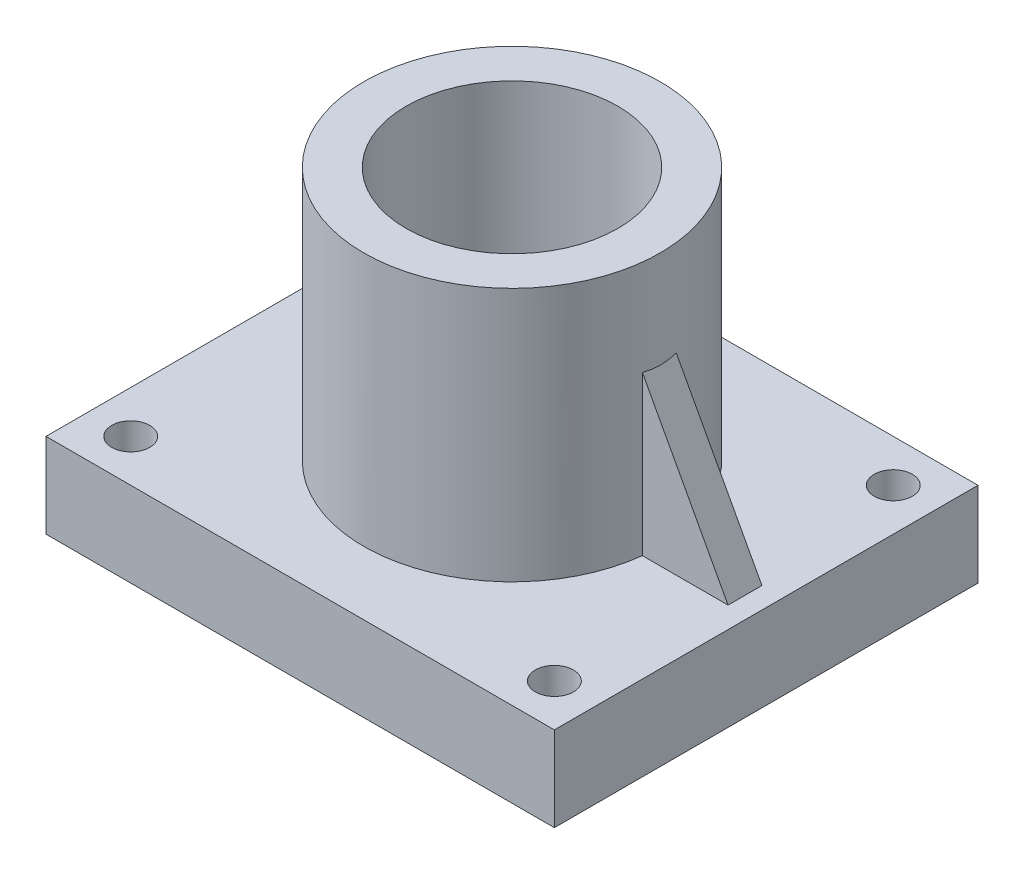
from build123d import *

# Parameters (mm, degrees)
SKETCH_1_W          = 120
SKETCH_1_H          = 100
EXTRUDE_1_DEPTH     = 20
SKETCH_2_R          = 35
EXTRUDE_2_DEPTH     = 60
SKETCH_3_R          = 25
CUT_EXTRUDE_1_DEPTH = 85
EXTRUDE_3_DEPTH     = 4
SKETCH_6_R          = 4.5
CUT_EXTRUDE_3_DEPTH = 25
SKETCH_7_R          = 4.5
CUT_EXTRUDE_4_DEPTH = 25
SKETCH_8_R          = 4.5
CUT_EXTRUDE_5_DEPTH = 25
SKETCH_9_R          = 4.5
CUT_EXTRUDE_6_DEPTH = 25


with BuildPart() as part:
    # Sketch 1 → Extrude 1 (new body)
    with BuildSketch(Plane(origin=(0, 0, 0), x_dir=(1, 0, 0), z_dir=(0, 1, 0))):
        Rectangle(SKETCH_1_W, SKETCH_1_H)
    extrude(amount=EXTRUDE_1_DEPTH)

    # Sketch 2 → Extrude 2 (add)
    with BuildSketch(Plane(origin=(0, 20, 0), x_dir=(1, 0, 0), z_dir=(0, 1, 0))):
        with Locations(Location((0, 0, 0), (0, 0, 270))):
            Circle(SKETCH_2_R)
    extrude(amount=EXTRUDE_2_DEPTH)

    # Sketch 3 → Cut-Extrude 1 (cut)
    with BuildSketch(Plane(origin=(0, 0, 0), x_dir=(1, 0, 0), z_dir=(0, 1, 0))):
        with Locations(Location((0, 0, 0), (0, 0, 270))):
            Circle(SKETCH_3_R)
    extrude(amount=CUT_EXTRUDE_1_DEPTH, mode=Mode.SUBTRACT)

    # Sketch 4 → Extrude 3 (add, symmetric)
    with BuildSketch(Plane.XY):
        Polygon((28, 20), (55, 20), (28, 70), align=None)
    extrude(amount=EXTRUDE_3_DEPTH, both=True)

    # Sketch 6 → Cut-Extrude 3 (cut)
    with BuildSketch(Plane(origin=(0, 0, 0), x_dir=(1, 0, 0), z_dir=(0, 1, 0))):
        with Locations(Location((50, 40, 0), (0, 0, 90))):
            Circle(SKETCH_6_R)
    extrude(amount=CUT_EXTRUDE_3_DEPTH, mode=Mode.SUBTRACT)

    # Sketch 7 → Cut-Extrude 4 (cut)
    with BuildSketch(Plane(origin=(0, 0, 0), x_dir=(1, 0, 0), z_dir=(0, 1, 0))):
        with Locations(Location((-50, 40, 0), (0, 0, 90))):
            Circle(SKETCH_7_R)
    extrude(amount=CUT_EXTRUDE_4_DEPTH, mode=Mode.SUBTRACT)

    # Sketch 8 → Cut-Extrude 5 (cut)
    with BuildSketch(Plane(origin=(0, 0, 0), x_dir=(1, 0, 0), z_dir=(0, 1, 0))):
        with Locations(Location((50, -40, 0), (0, 0, 90))):
            Circle(SKETCH_8_R)
    extrude(amount=CUT_EXTRUDE_5_DEPTH, mode=Mode.SUBTRACT)

    # Sketch 9 → Cut-Extrude 6 (cut)
    with BuildSketch(Plane(origin=(0, 0, 0), x_dir=(1, 0, 0), z_dir=(0, 1, 0))):
        with Locations(Location((-50, -40, 0), (0, 0, 90))):
            Circle(SKETCH_9_R)
    extrude(amount=CUT_EXTRUDE_6_DEPTH, mode=Mode.SUBTRACT)


solid = part.part
